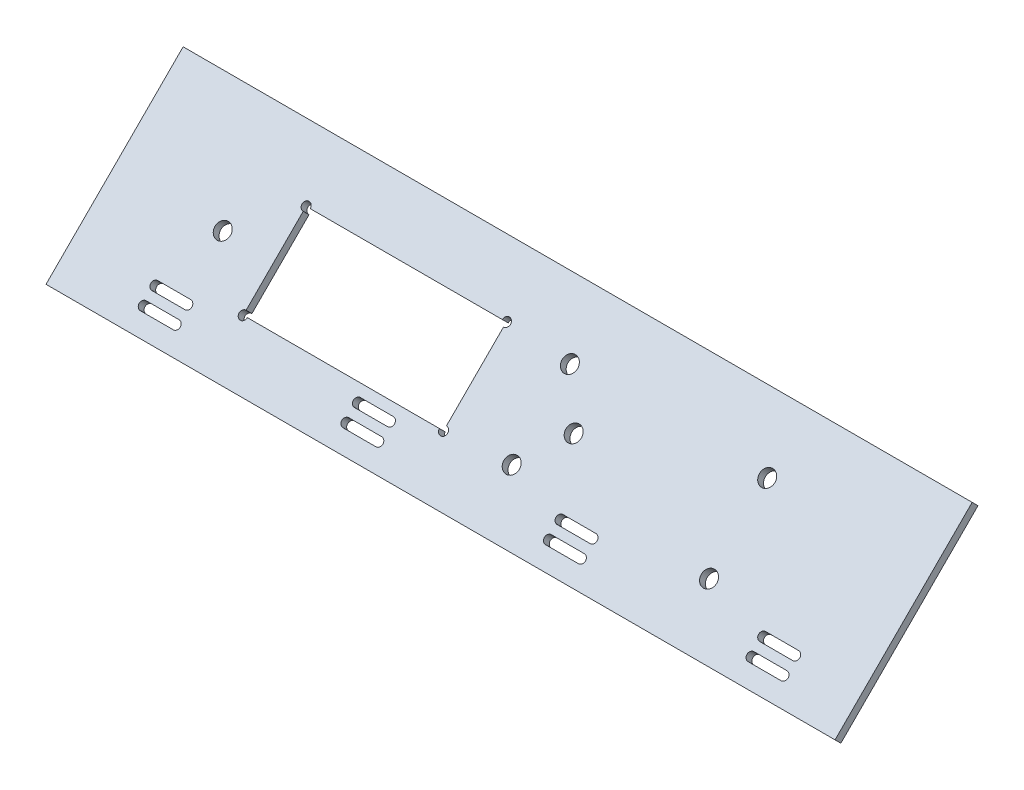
from build123d import *

# Parameters (mm, degrees)
SKETCH2_W           = 304.6625
SKETCH2_H           = 74.884871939
SKETCH2_R           = 3
BOSS_EXTRUDE1_DEPTH = 3.175
SKETCH3_W           = 77.35
SKETCH3_H           = 34.35
CUT_EXTRUDE1_DEPTH  = 3.175
SKETCH4_R           = 1.5875
CUT_EXTRUDE2_DEPTH  = 1176.162514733


with BuildPart() as part:
    # Sketch2 → Boss-Extrude1 (new body)
    with BuildSketch(Plane(origin=(0, 874.258201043, 874.258201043), x_dir=(1, 0, 0), z_dir=(0, 0.7071067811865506, 0.7071067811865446))):
        with Locations((-759.871620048, -701.841402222)):
            Rectangle(SKETCH2_W, SKETCH2_H)
        with Locations(Location((-670.971620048, -686.623966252, 0), (0, 0, 270))):
            Circle(SKETCH2_R, mode=Mode.SUBTRACT)
        with Locations(Location((-670.971620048, -718.373966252, 0), (0, 0, 270))):
            Circle(SKETCH2_R, mode=Mode.SUBTRACT)
        with Locations(Location((-747.171620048, -718.373966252, 0), (0, 0, 270))):
            Circle(SKETCH2_R, mode=Mode.SUBTRACT)
        with Locations(Location((-734.471620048, -702.498966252, 0), (0, 0, 270))):
            Circle(SKETCH2_R, mode=Mode.SUBTRACT)
        with Locations(Location((-747.171620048, -686.623966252, 0), (0, 0, 270))):
            Circle(SKETCH2_R, mode=Mode.SUBTRACT)
        with Locations(Location((-869.971620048, -702.498966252, 0), (0, 0, 270))):
            Circle(SKETCH2_R, mode=Mode.SUBTRACT)
        with BuildLine():
            Line((-880.452870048, -726.311466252), (-867.752870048, -726.311466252))
            ThreePointArc((-867.752870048, -726.311466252), (-866.165370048, -724.723966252), (-867.752870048, -723.136466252))
            Line((-867.752870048, -723.136466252), (-880.452870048, -723.136466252))
            ThreePointArc((-880.452870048, -723.136466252), (-882.040370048, -724.723966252), (-880.452870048, -726.311466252))
        make_face(mode=Mode.SUBTRACT)
        with BuildLine():
            Line((-867.752870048, -729.486466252), (-880.452870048, -729.486466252))
            ThreePointArc((-880.452870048, -729.486466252), (-882.040370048, -731.073966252), (-880.452870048, -732.661466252))
            Line((-880.452870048, -732.661466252), (-867.752870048, -732.661466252))
            ThreePointArc((-867.752870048, -732.661466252), (-866.165370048, -731.073966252), (-867.752870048, -729.486466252))
        make_face(mode=Mode.SUBTRACT)
        with BuildLine():
            Line((-802.220870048, -732.661466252), (-789.520870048, -732.661466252))
            ThreePointArc((-789.520870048, -732.661466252), (-787.933370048, -731.073966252), (-789.520870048, -729.486466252))
            Line((-789.520870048, -729.486466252), (-802.220870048, -729.486466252))
            ThreePointArc((-802.220870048, -729.486466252), (-803.808370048, -731.073966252), (-802.220870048, -732.661466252))
        make_face(mode=Mode.SUBTRACT)
        with BuildLine():
            Line((-802.220870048, -726.311466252), (-789.520870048, -726.311466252))
            ThreePointArc((-789.520870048, -726.311466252), (-787.933370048, -724.723966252), (-789.520870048, -723.136466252))
            Line((-789.520870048, -723.136466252), (-802.220870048, -723.136466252))
            ThreePointArc((-802.220870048, -723.136466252), (-803.808370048, -724.723966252), (-802.220870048, -726.311466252))
        make_face(mode=Mode.SUBTRACT)
        with BuildLine():
            Line((-711.288870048, -723.136466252), (-723.988870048, -723.136466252))
            ThreePointArc((-723.988870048, -723.136466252), (-725.576370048, -724.723966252), (-723.988870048, -726.311466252))
            Line((-723.988870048, -726.311466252), (-711.288870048, -726.311466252))
            ThreePointArc((-711.288870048, -726.311466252), (-709.701370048, -724.723966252), (-711.288870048, -723.136466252))
        make_face(mode=Mode.SUBTRACT)
        with BuildLine():
            Line((-711.288870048, -729.486466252), (-723.988870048, -729.486466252))
            ThreePointArc((-723.988870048, -729.486466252), (-725.576370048, -731.073966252), (-723.988870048, -732.661466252))
            Line((-723.988870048, -732.661466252), (-711.288870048, -732.661466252))
            ThreePointArc((-711.288870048, -732.661466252), (-709.701370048, -731.073966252), (-711.288870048, -729.486466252))
        make_face(mode=Mode.SUBTRACT)
        with BuildLine():
            Line((-645.756870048, -726.311466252), (-633.056870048, -726.311466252))
            ThreePointArc((-633.056870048, -726.311466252), (-631.469370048, -724.723966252), (-633.056870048, -723.136466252))
            Line((-633.056870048, -723.136466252), (-645.756870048, -723.136466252))
            ThreePointArc((-645.756870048, -723.136466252), (-647.344370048, -724.723966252), (-645.756870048, -726.311466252))
        make_face(mode=Mode.SUBTRACT)
        with BuildLine():
            Line((-633.056870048, -729.486466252), (-645.756870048, -729.486466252))
            ThreePointArc((-645.756870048, -729.486466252), (-647.344370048, -731.073966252), (-645.756870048, -732.661466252))
            Line((-645.756870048, -732.661466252), (-633.056870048, -732.661466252))
            ThreePointArc((-633.056870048, -732.661466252), (-631.469370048, -731.073966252), (-633.056870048, -729.486466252))
        make_face(mode=Mode.SUBTRACT)
    extrude(amount=BOSS_EXTRUDE1_DEPTH)

    # Sketch3 → Cut-Extrude1 (cut)
    with BuildSketch(Plane(origin=(0, 876.503265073, 876.503265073), x_dir=(1, 0, 0), z_dir=(0, 0.7071067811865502, 0.7071067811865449))):
        with Locations((-811.246620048, -702.498966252)):
            Rectangle(SKETCH3_W, SKETCH3_H)
    extrude(amount=-CUT_EXTRUDE1_DEPTH, mode=Mode.SUBTRACT)

    # Sketch4 → Cut-Extrude2 (cut, through all)
    with BuildSketch(Plane(origin=(0, 876.503265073, 876.503265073), x_dir=(1, 0, 0), z_dir=(0, 0.7071067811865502, 0.7071067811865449))):
        with Locations((-849.921620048, -685.323966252)):
            Circle(SKETCH4_R)
        with Locations((-849.921620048, -719.673966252)):
            Circle(SKETCH4_R)
        with Locations((-772.571620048, -719.673966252)):
            Circle(SKETCH4_R)
        with Locations((-772.571620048, -685.323966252)):
            Circle(SKETCH4_R)
    extrude(amount=-CUT_EXTRUDE2_DEPTH, mode=Mode.SUBTRACT)


solid = part.part
